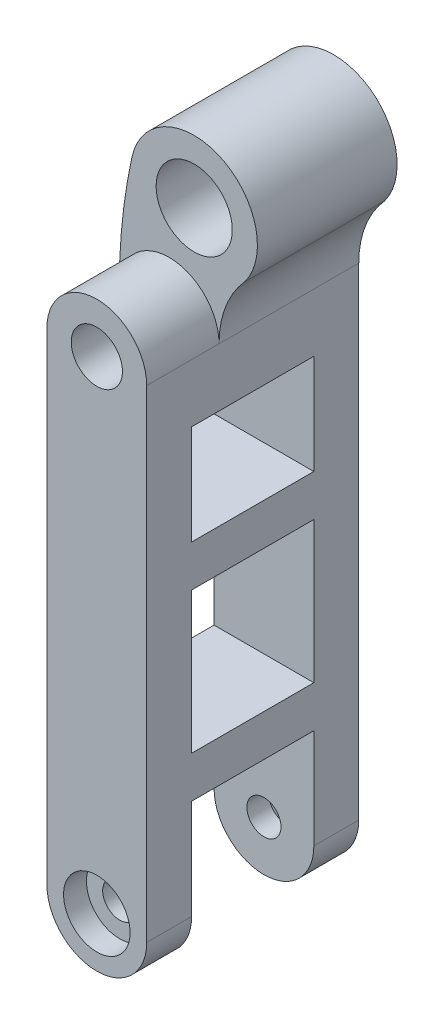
from build123d import *

# Parameters (mm, degrees)
SKETCH_1_R           = 3.08
SKETCH_1_R_2         = 2.05
EXTRUDE_7_DEPTH      = 25.5
SKETCH_6_W           = 14.7
SKETCH_6_H           = 18
SKETCH_6_H_2         = 17
SKETCH_6_H_3         = 12
CUT_EXTRUDE_1_DEPTH  = 20
EXTRUDE_8_DEPTH      = 12.75
EXTRUDE_8_DEPTH_BACK = 4.05
SKETCH_8_R           = 4.58
SKETCH_9_R           = 4
CUT_EXTRUDE_2_DEPTH  = 2.75
CUT_EXTRUDE_3_DEPTH  = 2.75


with BuildPart() as part:
    # Sketch 1 → Extrude 7 (new body)
    with BuildSketch(Plane.XY):
        with BuildLine():
            Line((0, 0), (0, 58))
            ThreePointArc((0, 58), (6, 64), (12, 58))
            Line((12, 58), (12, 0))
            ThreePointArc((12, 0), (6, -6), (0, 0))
        make_face()
        with Locations((6, 58)):
            Circle(SKETCH_1_R, mode=Mode.SUBTRACT)
        with Locations((6, 0)):
            Circle(SKETCH_1_R_2, mode=Mode.SUBTRACT)
    extrude(amount=-EXTRUDE_7_DEPTH)

    # Sketch 6 → Cut-Extrude 1 (cut)
    with BuildSketch(Plane(origin=(12, 0, 0), x_dir=(0, 0, -1), z_dir=(1, 0, 0))):
        with Locations((12.75, 3)):
            Rectangle(SKETCH_6_W, SKETCH_6_H)
        with Locations((12.75, 25.5)):
            Rectangle(SKETCH_6_W, SKETCH_6_H_2)
        with Locations((12.75, 45)):
            Rectangle(SKETCH_6_W, SKETCH_6_H_3)
    extrude(amount=-CUT_EXTRUDE_1_DEPTH, mode=Mode.SUBTRACT)

    # Sketch 8 → Extrude 8 (add, two sides: drawn at the far end of the back side and taken through both)
    with BuildSketch(Plane(origin=(0, 0, -12.75), x_dir=(-1, 0, 0), z_dir=(0, 0, -1)).offset(-EXTRUDE_8_DEPTH_BACK)):
        with BuildLine():
            Line((-12, 58), (-12, 56.499795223))
            Line((-12, 56.499795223), (-8.237778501, 61.53127993))
            Line((-8.237778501, 61.53127993), (-2.748886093, 61.53127993))
            Line((-2.748886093, 61.53127993), (0, 56.042387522))
            Line((0, 56.042387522), (0, 58))
            ThreePointArc((0, 58), (-0.381285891, 65.137203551), (-1.520803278, 72.193162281))
            ThreePointArc((-1.520803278, 72.193162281), (-12.151968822, 77.519203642), (-15.087770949, 65.996640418))
            ThreePointArc((-15.087770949, 65.996640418), (-12.798752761, 62.28604093), (-12, 58))
        make_face()
        with Locations((-9.012708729, 70.64595424)):
            Circle(SKETCH_8_R, mode=Mode.SUBTRACT)
    extrude(amount=EXTRUDE_8_DEPTH + EXTRUDE_8_DEPTH_BACK)

    # Sketch 9 → Cut-Extrude 2 (cut)
    with BuildSketch(Plane.XY):
        with Locations((6, 0)):
            Circle(SKETCH_9_R)
    extrude(amount=-CUT_EXTRUDE_2_DEPTH, mode=Mode.SUBTRACT)

    # Sketch 10 → Cut-Extrude 3 (cut)
    with BuildSketch(Plane(origin=(0, 0, -25.5), x_dir=(-1, 0, 0), z_dir=(0, 0, -1))):
        Polygon((-2, 0), (-4, 3.464101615), (-8, 3.464101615), (-10, 0), (-8, -3.464101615), (-4, -3.464101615), align=None)
    extrude(amount=-CUT_EXTRUDE_3_DEPTH, mode=Mode.SUBTRACT)


solid = part.part
